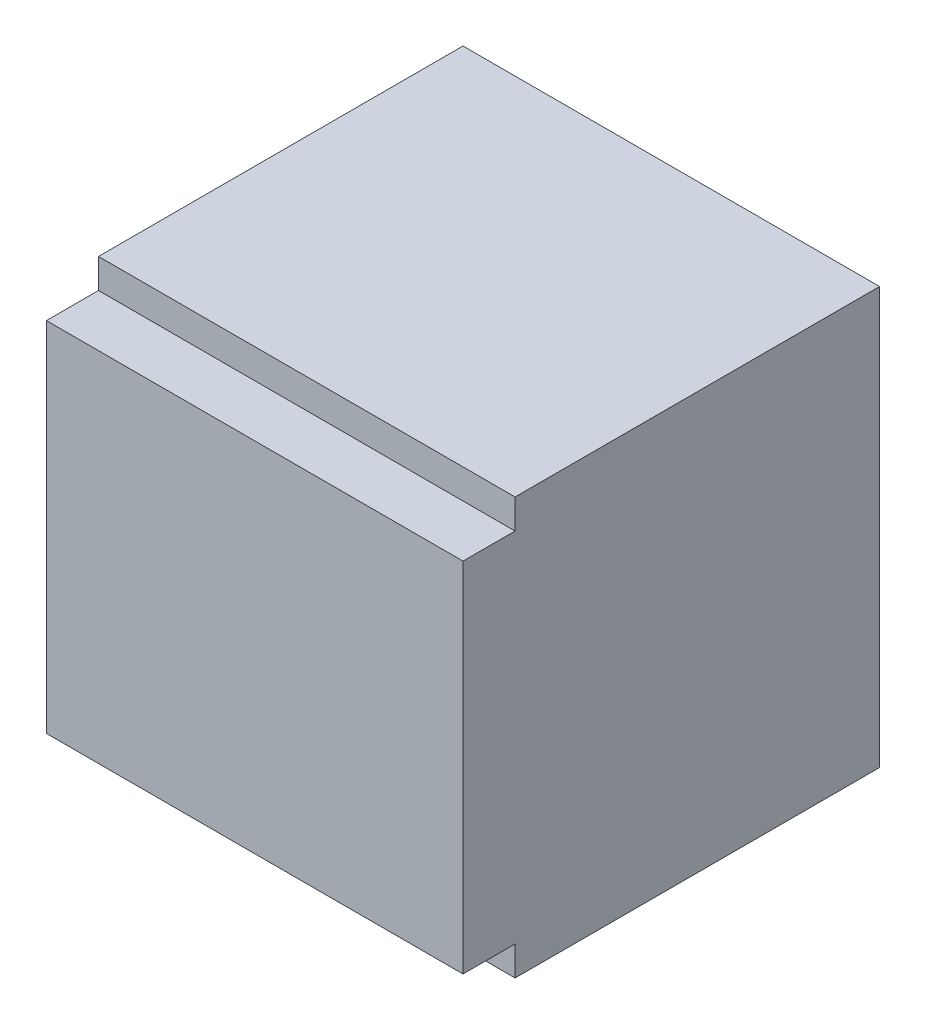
ISO-10303-21;
HEADER;
FILE_DESCRIPTION(('STEP AP214'),'2;1');
FILE_NAME('part.step','',(''),(''),'','','');
FILE_SCHEMA(('AUTOMOTIVE_DESIGN { 1 0 10303 214 1 1 1 1 }'));
ENDSEC;
DATA;
#1=APPLICATION_CONTEXT('core data for automotive mechanical design processes');
#2=APPLICATION_PROTOCOL_DEFINITION('international standard','automotive_design',2000,#1);
#3=PRODUCT_CONTEXT('',#1,'mechanical');
#4=PRODUCT('Part','Part','',(#3));
#5=PRODUCT_RELATED_PRODUCT_CATEGORY('part','',(#4));
#6=PRODUCT_DEFINITION_FORMATION('','',#4);
#7=PRODUCT_DEFINITION_CONTEXT('part definition',#1,'design');
#8=PRODUCT_DEFINITION('design','',#6,#7);
#9=PRODUCT_DEFINITION_SHAPE('','',#8);
#10=(LENGTH_UNIT() NAMED_UNIT(*) SI_UNIT(.MILLI.,.METRE.));
#11=(NAMED_UNIT(*) PLANE_ANGLE_UNIT() SI_UNIT($,.RADIAN.));
#12=(NAMED_UNIT(*) SI_UNIT($,.STERADIAN.) SOLID_ANGLE_UNIT());
#13=UNCERTAINTY_MEASURE_WITH_UNIT(LENGTH_MEASURE(1.E-05),#10,'distance_accuracy_value','');
#14=(GEOMETRIC_REPRESENTATION_CONTEXT(3) GLOBAL_UNCERTAINTY_ASSIGNED_CONTEXT((#13)) GLOBAL_UNIT_ASSIGNED_CONTEXT((#10,
#11,#12)) REPRESENTATION_CONTEXT('',''));
#15=CARTESIAN_POINT('',(0.,0.,0.));
#16=DIRECTION('',(0.,0.,1.));
#17=DIRECTION('',(1.,0.,0.));
#18=AXIS2_PLACEMENT_3D('',#15,#16,#17);
#19=CARTESIAN_POINT('',(6.,6.,0.));
#20=DIRECTION('',(0.,0.,-1.));
#21=DIRECTION('',(0.,1.,0.));
#22=AXIS2_PLACEMENT_3D('',#19,#20,#21);
#23=PLANE('',#22);
#24=DIRECTION('',(-1.,0.,0.));
#25=VECTOR('',#24,1.);
#26=CARTESIAN_POINT('',(6.,6.,0.));
#27=LINE('',#26,#25);
#28=CARTESIAN_POINT('',(6.,6.,0.));
#29=VERTEX_POINT('',#28);
#30=CARTESIAN_POINT('',(-6.,6.,0.));
#31=VERTEX_POINT('',#30);
#32=EDGE_CURVE('E9',#29,#31,#27,.T.);
#33=ORIENTED_EDGE('',*,*,#32,.F.);
#34=DIRECTION('',(0.,-1.,0.));
#35=VECTOR('',#34,1.);
#36=CARTESIAN_POINT('',(6.,6.,0.));
#37=LINE('',#36,#35);
#38=CARTESIAN_POINT('',(6.,-6.,0.));
#39=VERTEX_POINT('',#38);
#40=EDGE_CURVE('E81',#29,#39,#37,.T.);
#41=ORIENTED_EDGE('',*,*,#40,.T.);
#42=DIRECTION('',(-1.,0.,0.));
#43=VECTOR('',#42,1.);
#44=CARTESIAN_POINT('',(6.,-6.,0.));
#45=LINE('',#44,#43);
#46=CARTESIAN_POINT('',(-6.,-6.,0.));
#47=VERTEX_POINT('',#46);
#48=EDGE_CURVE('E76',#39,#47,#45,.T.);
#49=ORIENTED_EDGE('',*,*,#48,.T.);
#50=DIRECTION('',(0.,-1.,0.));
#51=VECTOR('',#50,1.);
#52=CARTESIAN_POINT('',(-6.,6.,0.));
#53=LINE('',#52,#51);
#54=EDGE_CURVE('E79',#31,#47,#53,.T.);
#55=ORIENTED_EDGE('',*,*,#54,.F.);
#56=EDGE_LOOP('',(#33,#41,#49,#55));
#57=FACE_BOUND('',#56,.T.);
#58=CARTESIAN_POINT('',(0.,0.,0.));
#59=DIRECTION('',(0.,0.,1.));
#60=DIRECTION('',(0.,-1.,0.));
#61=AXIS2_PLACEMENT_3D('',#58,#59,#60);
#62=CIRCLE('',#61,2.5);
#63=CARTESIAN_POINT('',(0.,-2.5,0.));
#64=VERTEX_POINT('',#63);
#65=EDGE_CURVE('E97',#64,#64,#62,.T.);
#66=ORIENTED_EDGE('',*,*,#65,.T.);
#67=EDGE_LOOP('',(#66));
#68=FACE_BOUND('',#67,.T.);
#69=ADVANCED_FACE('F15',(#57,#68),#23,.T.);
#70=CARTESIAN_POINT('',(6.,6.,10.5));
#71=DIRECTION('',(0.,1.,0.));
#72=DIRECTION('',(0.,0.,1.));
#73=AXIS2_PLACEMENT_3D('',#70,#71,#72);
#74=PLANE('',#73);
#75=DIRECTION('',(-1.,0.,0.));
#76=VECTOR('',#75,1.);
#77=CARTESIAN_POINT('',(6.,6.,10.5));
#78=LINE('',#77,#76);
#79=CARTESIAN_POINT('',(6.,6.,10.5));
#80=VERTEX_POINT('',#79);
#81=CARTESIAN_POINT('',(-6.,6.,10.5));
#82=VERTEX_POINT('',#81);
#83=EDGE_CURVE('E23',#80,#82,#78,.T.);
#84=ORIENTED_EDGE('',*,*,#83,.F.);
#85=DIRECTION('',(0.,0.,-1.));
#86=VECTOR('',#85,1.);
#87=CARTESIAN_POINT('',(6.,6.,10.5));
#88=LINE('',#87,#86);
#89=EDGE_CURVE('E87',#80,#29,#88,.T.);
#90=ORIENTED_EDGE('',*,*,#89,.T.);
#91=ORIENTED_EDGE('',*,*,#32,.T.);
#92=DIRECTION('',(0.,0.,-1.));
#93=VECTOR('',#92,1.);
#94=CARTESIAN_POINT('',(-6.,6.,10.5));
#95=LINE('',#94,#93);
#96=EDGE_CURVE('E96',#82,#31,#95,.T.);
#97=ORIENTED_EDGE('',*,*,#96,.F.);
#98=EDGE_LOOP('',(#84,#90,#91,#97));
#99=FACE_BOUND('',#98,.T.);
#100=ADVANCED_FACE('F17',(#99),#74,.T.);
#101=CARTESIAN_POINT('',(6.,5.15,10.5));
#102=DIRECTION('',(0.,0.,1.));
#103=DIRECTION('',(0.,-1.,0.));
#104=AXIS2_PLACEMENT_3D('',#101,#102,#103);
#105=PLANE('',#104);
#106=DIRECTION('',(-1.,0.,0.));
#107=VECTOR('',#106,1.);
#108=CARTESIAN_POINT('',(6.,5.15,10.5));
#109=LINE('',#108,#107);
#110=CARTESIAN_POINT('',(6.,5.15,10.5));
#111=VERTEX_POINT('',#110);
#112=CARTESIAN_POINT('',(-6.,5.15,10.5));
#113=VERTEX_POINT('',#112);
#114=EDGE_CURVE('E142',#111,#113,#109,.T.);
#115=ORIENTED_EDGE('',*,*,#114,.F.);
#116=DIRECTION('',(0.,1.,0.));
#117=VECTOR('',#116,1.);
#118=CARTESIAN_POINT('',(6.,5.15,10.5));
#119=LINE('',#118,#117);
#120=EDGE_CURVE('E132',#111,#80,#119,.T.);
#121=ORIENTED_EDGE('',*,*,#120,.T.);
#122=ORIENTED_EDGE('',*,*,#83,.T.);
#123=DIRECTION('',(0.,1.,0.));
#124=VECTOR('',#123,1.);
#125=CARTESIAN_POINT('',(-6.,5.15,10.5));
#126=LINE('',#125,#124);
#127=EDGE_CURVE('E114',#113,#82,#126,.T.);
#128=ORIENTED_EDGE('',*,*,#127,.F.);
#129=EDGE_LOOP('',(#115,#121,#122,#128));
#130=FACE_BOUND('',#129,.T.);
#131=ADVANCED_FACE('F145',(#130),#105,.T.);
#132=CARTESIAN_POINT('',(6.,5.15,12.));
#133=DIRECTION('',(0.,1.,0.));
#134=DIRECTION('',(0.,0.,1.));
#135=AXIS2_PLACEMENT_3D('',#132,#133,#134);
#136=PLANE('',#135);
#137=DIRECTION('',(-1.,0.,0.));
#138=VECTOR('',#137,1.);
#139=CARTESIAN_POINT('',(6.,5.15,12.));
#140=LINE('',#139,#138);
#141=CARTESIAN_POINT('',(6.,5.15,12.));
#142=VERTEX_POINT('',#141);
#143=CARTESIAN_POINT('',(-6.,5.15,12.));
#144=VERTEX_POINT('',#143);
#145=EDGE_CURVE('E140',#142,#144,#140,.T.);
#146=ORIENTED_EDGE('',*,*,#145,.F.);
#147=DIRECTION('',(0.,0.,-1.));
#148=VECTOR('',#147,1.);
#149=CARTESIAN_POINT('',(6.,5.15,12.));
#150=LINE('',#149,#148);
#151=EDGE_CURVE('E129',#142,#111,#150,.T.);
#152=ORIENTED_EDGE('',*,*,#151,.T.);
#153=ORIENTED_EDGE('',*,*,#114,.T.);
#154=DIRECTION('',(0.,0.,-1.));
#155=VECTOR('',#154,1.);
#156=CARTESIAN_POINT('',(-6.,5.15,12.));
#157=LINE('',#156,#155);
#158=EDGE_CURVE('E111',#144,#113,#157,.T.);
#159=ORIENTED_EDGE('',*,*,#158,.F.);
#160=EDGE_LOOP('',(#146,#152,#153,#159));
#161=FACE_BOUND('',#160,.T.);
#162=ADVANCED_FACE('F164',(#161),#136,.T.);
#163=CARTESIAN_POINT('',(6.,-5.15,12.));
#164=DIRECTION('',(0.,0.,1.));
#165=DIRECTION('',(0.,-1.,0.));
#166=AXIS2_PLACEMENT_3D('',#163,#164,#165);
#167=PLANE('',#166);
#168=DIRECTION('',(-1.,0.,0.));
#169=VECTOR('',#168,1.);
#170=CARTESIAN_POINT('',(6.,-5.15,12.));
#171=LINE('',#170,#169);
#172=CARTESIAN_POINT('',(6.,-5.15,12.));
#173=VERTEX_POINT('',#172);
#174=CARTESIAN_POINT('',(-6.,-5.15,12.));
#175=VERTEX_POINT('',#174);
#176=EDGE_CURVE('E138',#173,#175,#171,.T.);
#177=ORIENTED_EDGE('',*,*,#176,.F.);
#178=DIRECTION('',(0.,1.,0.));
#179=VECTOR('',#178,1.);
#180=CARTESIAN_POINT('',(6.,-5.15,12.));
#181=LINE('',#180,#179);
#182=EDGE_CURVE('E126',#173,#142,#181,.T.);
#183=ORIENTED_EDGE('',*,*,#182,.T.);
#184=ORIENTED_EDGE('',*,*,#145,.T.);
#185=DIRECTION('',(0.,1.,0.));
#186=VECTOR('',#185,1.);
#187=CARTESIAN_POINT('',(-6.,-5.15,12.));
#188=LINE('',#187,#186);
#189=EDGE_CURVE('E108',#175,#144,#188,.T.);
#190=ORIENTED_EDGE('',*,*,#189,.F.);
#191=EDGE_LOOP('',(#177,#183,#184,#190));
#192=FACE_BOUND('',#191,.T.);
#193=ADVANCED_FACE('F162',(#192),#167,.T.);
#194=CARTESIAN_POINT('',(6.,-5.15,12.));
#195=DIRECTION('',(0.,1.,0.));
#196=DIRECTION('',(0.,0.,1.));
#197=AXIS2_PLACEMENT_3D('',#194,#195,#196);
#198=PLANE('',#197);
#199=DIRECTION('',(-1.,0.,0.));
#200=VECTOR('',#199,1.);
#201=CARTESIAN_POINT('',(6.,-5.15,10.5));
#202=LINE('',#201,#200);
#203=CARTESIAN_POINT('',(6.,-5.15,10.5));
#204=VERTEX_POINT('',#203);
#205=CARTESIAN_POINT('',(-6.,-5.15,10.5));
#206=VERTEX_POINT('',#205);
#207=EDGE_CURVE('E136',#204,#206,#202,.T.);
#208=ORIENTED_EDGE('',*,*,#207,.F.);
#209=DIRECTION('',(0.,0.,-1.));
#210=VECTOR('',#209,1.);
#211=CARTESIAN_POINT('',(6.,-5.15,12.));
#212=LINE('',#211,#210);
#213=EDGE_CURVE('E123',#173,#204,#212,.T.);
#214=ORIENTED_EDGE('',*,*,#213,.F.);
#215=ORIENTED_EDGE('',*,*,#176,.T.);
#216=DIRECTION('',(0.,0.,-1.));
#217=VECTOR('',#216,1.);
#218=CARTESIAN_POINT('',(-6.,-5.15,12.));
#219=LINE('',#218,#217);
#220=EDGE_CURVE('E102',#175,#206,#219,.T.);
#221=ORIENTED_EDGE('',*,*,#220,.T.);
#222=EDGE_LOOP('',(#208,#214,#215,#221));
#223=FACE_BOUND('',#222,.T.);
#224=ADVANCED_FACE('F160',(#223),#198,.F.);
#225=CARTESIAN_POINT('',(6.,-5.15,10.5));
#226=DIRECTION('',(0.,0.,-1.));
#227=DIRECTION('',(0.,1.,0.));
#228=AXIS2_PLACEMENT_3D('',#225,#226,#227);
#229=PLANE('',#228);
#230=DIRECTION('',(-1.,0.,0.));
#231=VECTOR('',#230,1.);
#232=CARTESIAN_POINT('',(6.,-6.,10.5));
#233=LINE('',#232,#231);
#234=CARTESIAN_POINT('',(6.,-6.,10.5));
#235=VERTEX_POINT('',#234);
#236=CARTESIAN_POINT('',(-6.,-6.,10.5));
#237=VERTEX_POINT('',#236);
#238=EDGE_CURVE('E86',#235,#237,#233,.T.);
#239=ORIENTED_EDGE('',*,*,#238,.F.);
#240=DIRECTION('',(0.,-1.,0.));
#241=VECTOR('',#240,1.);
#242=CARTESIAN_POINT('',(6.,-5.15,10.5));
#243=LINE('',#242,#241);
#244=EDGE_CURVE('E120',#204,#235,#243,.T.);
#245=ORIENTED_EDGE('',*,*,#244,.F.);
#246=ORIENTED_EDGE('',*,*,#207,.T.);
#247=DIRECTION('',(0.,-1.,0.));
#248=VECTOR('',#247,1.);
#249=CARTESIAN_POINT('',(-6.,-5.15,10.5));
#250=LINE('',#249,#248);
#251=EDGE_CURVE('E100',#206,#237,#250,.T.);
#252=ORIENTED_EDGE('',*,*,#251,.T.);
#253=EDGE_LOOP('',(#239,#245,#246,#252));
#254=FACE_BOUND('',#253,.T.);
#255=ADVANCED_FACE('F156',(#254),#229,.F.);
#256=CARTESIAN_POINT('',(6.,-6.,0.));
#257=DIRECTION('',(0.,-1.,0.));
#258=DIRECTION('',(0.,0.,-1.));
#259=AXIS2_PLACEMENT_3D('',#256,#257,#258);
#260=PLANE('',#259);
#261=DIRECTION('',(0.,0.,1.));
#262=VECTOR('',#261,1.);
#263=CARTESIAN_POINT('',(6.,-6.,0.));
#264=LINE('',#263,#262);
#265=EDGE_CURVE('E118',#39,#235,#264,.T.);
#266=ORIENTED_EDGE('',*,*,#265,.T.);
#267=ORIENTED_EDGE('',*,*,#238,.T.);
#268=DIRECTION('',(0.,0.,1.));
#269=VECTOR('',#268,1.);
#270=CARTESIAN_POINT('',(-6.,-6.,0.));
#271=LINE('',#270,#269);
#272=EDGE_CURVE('E93',#47,#237,#271,.T.);
#273=ORIENTED_EDGE('',*,*,#272,.F.);
#274=ORIENTED_EDGE('',*,*,#48,.F.);
#275=EDGE_LOOP('',(#266,#267,#273,#274));
#276=FACE_BOUND('',#275,.T.);
#277=ADVANCED_FACE('F99',(#276),#260,.T.);
#278=CARTESIAN_POINT('',(6.,-5.15,0.));
#279=DIRECTION('',(1.,0.,0.));
#280=DIRECTION('',(0.,0.,1.));
#281=AXIS2_PLACEMENT_3D('',#278,#279,#280);
#282=PLANE('',#281);
#283=ORIENTED_EDGE('',*,*,#40,.F.);
#284=ORIENTED_EDGE('',*,*,#89,.F.);
#285=ORIENTED_EDGE('',*,*,#120,.F.);
#286=ORIENTED_EDGE('',*,*,#151,.F.);
#287=ORIENTED_EDGE('',*,*,#182,.F.);
#288=ORIENTED_EDGE('',*,*,#213,.T.);
#289=ORIENTED_EDGE('',*,*,#244,.T.);
#290=ORIENTED_EDGE('',*,*,#265,.F.);
#291=EDGE_LOOP('',(#283,#284,#285,#286,#287,#288,#289,#290));
#292=FACE_BOUND('',#291,.T.);
#293=ADVANCED_FACE('F150',(#292),#282,.T.);
#294=CARTESIAN_POINT('',(-6.,-5.15,0.));
#295=DIRECTION('',(1.,0.,0.));
#296=DIRECTION('',(0.,0.,1.));
#297=AXIS2_PLACEMENT_3D('',#294,#295,#296);
#298=PLANE('',#297);
#299=ORIENTED_EDGE('',*,*,#54,.T.);
#300=ORIENTED_EDGE('',*,*,#272,.T.);
#301=ORIENTED_EDGE('',*,*,#251,.F.);
#302=ORIENTED_EDGE('',*,*,#220,.F.);
#303=ORIENTED_EDGE('',*,*,#189,.T.);
#304=ORIENTED_EDGE('',*,*,#158,.T.);
#305=ORIENTED_EDGE('',*,*,#127,.T.);
#306=ORIENTED_EDGE('',*,*,#96,.T.);
#307=EDGE_LOOP('',(#299,#300,#301,#302,#303,#304,#305,#306));
#308=FACE_BOUND('',#307,.T.);
#309=ADVANCED_FACE('F91',(#308),#298,.F.);
#310=CARTESIAN_POINT('',(0.,0.,6.5));
#311=DIRECTION('',(0.,0.,-1.));
#312=DIRECTION('',(0.,1.,0.));
#313=AXIS2_PLACEMENT_3D('',#310,#311,#312);
#314=CYLINDRICAL_SURFACE('',#313,2.5);
#315=ORIENTED_EDGE('',*,*,#65,.F.);
#316=EDGE_LOOP('',(#315));
#317=FACE_BOUND('',#316,.T.);
#318=CARTESIAN_POINT('',(0.,0.,7.8));
#319=DIRECTION('',(0.,0.,-1.));
#320=DIRECTION('',(-1.,0.,0.));
#321=AXIS2_PLACEMENT_3D('',#318,#319,#320);
#322=CIRCLE('',#321,2.5);
#323=CARTESIAN_POINT('',(-2.5,0.,7.8));
#324=VERTEX_POINT('',#323);
#325=EDGE_CURVE('E273',#324,#324,#322,.T.);
#326=ORIENTED_EDGE('',*,*,#325,.F.);
#327=EDGE_LOOP('',(#326));
#328=FACE_BOUND('',#327,.T.);
#329=ADVANCED_FACE('F221',(#317,#328),#314,.F.);
#330=CARTESIAN_POINT('',(0.,0.,7.8));
#331=DIRECTION('',(0.,0.,-1.));
#332=DIRECTION('',(-1.,0.,0.));
#333=AXIS2_PLACEMENT_3D('',#330,#331,#332);
#334=PLANE('',#333);
#335=ORIENTED_EDGE('',*,*,#325,.T.);
#336=EDGE_LOOP('',(#335));
#337=FACE_BOUND('',#336,.T.);
#338=ADVANCED_FACE('F228',(#337),#334,.T.);
#339=CLOSED_SHELL('',(#69,#100,#131,#162,#193,#224,#255,#277,#293,#309,#329,#338));
#340=MANIFOLD_SOLID_BREP('B1',#339);
#341=ADVANCED_BREP_SHAPE_REPRESENTATION('',(#18,#340),#14);
#342=SHAPE_DEFINITION_REPRESENTATION(#9,#341);
ENDSEC;
END-ISO-10303-21;
